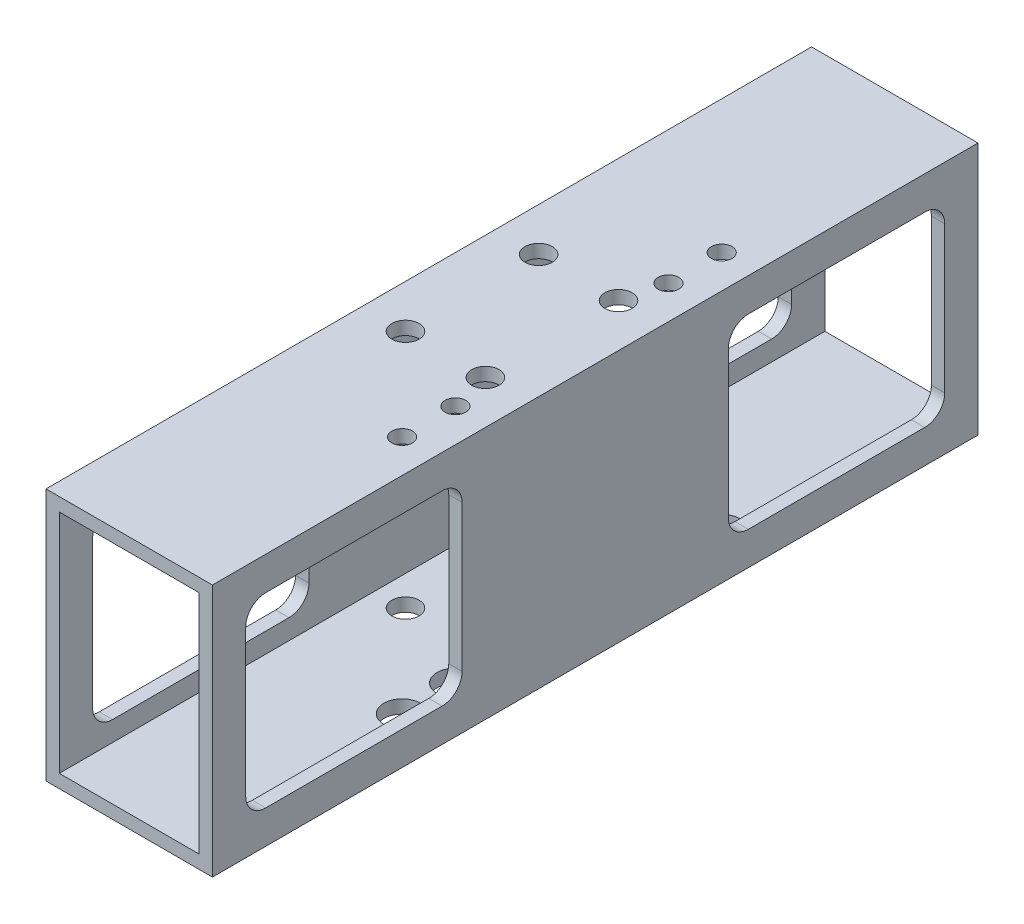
from build123d import *

# Parameters (mm, degrees)
SKETCH_1_W          = 25
SKETCH_1_H          = 38
SKETCH_1_W_2        = 21
SKETCH_1_H_2        = 34
EXTRUDE_1_DEPTH     = 115
SKETCH_2_R          = 2.05
CUT_EXTRUDE_1_DEPTH = 135
CUT_EXTRUDE_2_DEPTH = 28
SKETCH_4_R          = 1.55
CUT_EXTRUDE_3_DEPTH = 71
SKETCH_5_R          = 2.75
CUT_EXTRUDE_4_DEPTH = 10


with BuildPart() as part:
    # Sketch 1 → Extrude 1 (new body)
    with BuildSketch(Plane.XY):
        Rectangle(SKETCH_1_W, SKETCH_1_H)
        Rectangle(SKETCH_1_W_2, SKETCH_1_H_2, mode=Mode.SUBTRACT)
    extrude(amount=EXTRUDE_1_DEPTH)

    # Sketch 2 → Cut-Extrude 1 (cut)
    with BuildSketch(Plane(origin=(0, 19, 0), x_dir=(1, 0, 0), z_dir=(0, 1, 0))):
        with Locations(Location((-6, -47.5, 0), (0, 0, 270))):
            Circle(SKETCH_2_R)
        with Locations(Location((6, -47.5, 0), (0, 0, 270))):
            Circle(SKETCH_2_R)
        with Locations(Location((6, -67.5, 0), (0, 0, 270))):
            Circle(SKETCH_2_R)
        with Locations(Location((-6, -67.5, 0), (0, 0, 270))):
            Circle(SKETCH_2_R)
    extrude(amount=-CUT_EXTRUDE_1_DEPTH, mode=Mode.SUBTRACT)

    # Sketch 3 → Cut-Extrude 2 (cut)
    with BuildSketch(Plane.ZY.offset(12.5)):
        with BuildLine():
            Line((77.5, 11), (77.5, -11))
            ThreePointArc((77.5, -11), (78.378679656, -13.121320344), (80.5, -14))
            Line((80.5, -14), (107, -14))
            ThreePointArc((107, -14), (109.121320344, -13.121320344), (110, -11))
            Line((110, -11), (110, 11))
            ThreePointArc((110, 11), (109.121320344, 13.121320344), (107, 14))
            Line((107, 14), (80.5, 14))
            ThreePointArc((80.5, 14), (78.378679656, 13.121320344), (77.5, 11))
        make_face()
        with BuildLine():
            Line((8, 14), (34.5, 14))
            ThreePointArc((34.5, 14), (36.621320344, 13.121320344), (37.5, 11))
            Line((37.5, 11), (37.5, -11))
            ThreePointArc((37.5, -11), (36.621320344, -13.121320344), (34.5, -14))
            Line((34.5, -14), (8, -14))
            ThreePointArc((8, -14), (5.878679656, -13.121320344), (5, -11))
            Line((5, -11), (5, 11))
            ThreePointArc((5, 11), (5.878679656, 13.121320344), (8, 14))
        make_face()
    extrude(amount=-CUT_EXTRUDE_2_DEPTH, mode=Mode.SUBTRACT)

    # Sketch 4 → Cut-Extrude 3 (cut)
    with BuildSketch(Plane.XZ.offset(19)):
        with Locations(Location((7.5, 73.5, 0), (0, 0, 270))):
            Circle(SKETCH_4_R)
        with Locations(Location((7.5, 81.5, 0), (0, 0, 270))):
            Circle(SKETCH_4_R)
        with Locations(Location((7.5, 33.5, 0), (0, 0, 270))):
            Circle(SKETCH_4_R)
        with Locations(Location((7.5, 41.5, 0), (0, 0, 270))):
            Circle(SKETCH_4_R)
    extrude(amount=-CUT_EXTRUDE_3_DEPTH, mode=Mode.SUBTRACT)

    # Sketch 5 → Cut-Extrude 4 (cut)
    with BuildSketch(Plane.XZ.offset(19)):
        with Locations(Location((7.5, 81.5, 0), (0, 0, 270))):
            Circle(SKETCH_5_R)
        with Locations(Location((7.5, 73.5, 0), (0, 0, 270))):
            Circle(SKETCH_5_R)
        with Locations(Location((7.5, 41.5, 0), (0, 0, 270))):
            Circle(SKETCH_5_R)
        with Locations(Location((7.5, 33.5, 0), (0, 0, 270))):
            Circle(SKETCH_5_R)
    extrude(amount=-CUT_EXTRUDE_4_DEPTH, mode=Mode.SUBTRACT)


solid = part.part
